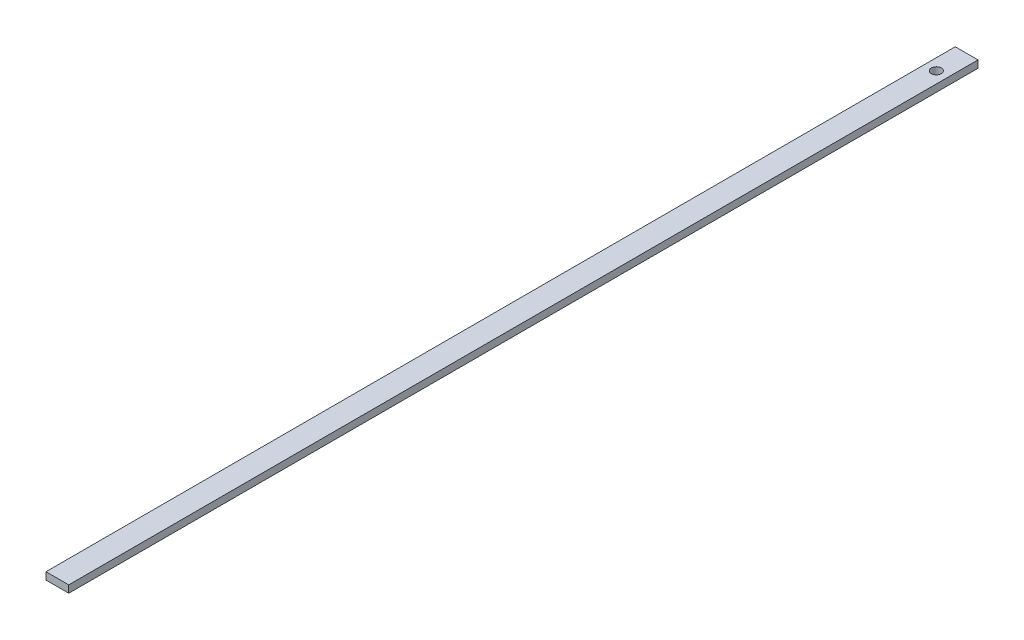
from build123d import *

# Parameters (mm, degrees)
ESQUISSE1_W           = 7.5
ESQUISSE1_H           = 2.4
BASE_EXTRUSION_DEPTH  = 300
TROU_TARAUD_M4X0_71_D = 3.3


with BuildPart() as part:
    # Esquisse1 → Base-Extrusion (new body)
    with BuildSketch(Plane.XY):
        with Locations((3.75, 1.2)):
            Rectangle(ESQUISSE1_W, ESQUISSE1_H)
    extrude(amount=BASE_EXTRUSION_DEPTH)

    # Trou taraud_ M4x0.71 (through all)
    with Locations(Plane(origin=(0, 2.4, 0), x_dir=(-1, 0, 0), z_dir=(0, 1, 0))):
        with Locations((-3.75, 10)):
            Hole(TROU_TARAUD_M4X0_71_D / 2)


solid = part.part
